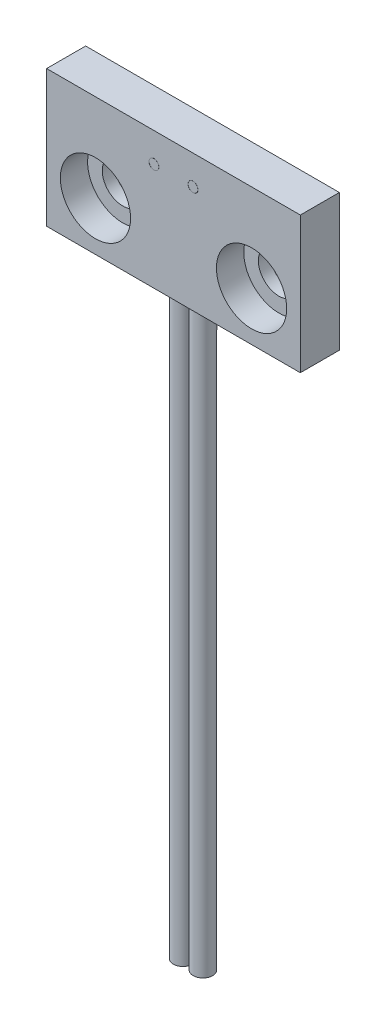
ISO-10303-21;
HEADER;
FILE_DESCRIPTION(('STEP AP214'),'2;1');
FILE_NAME('part.step','',(''),(''),'','','');
FILE_SCHEMA(('AUTOMOTIVE_DESIGN { 1 0 10303 214 1 1 1 1 }'));
ENDSEC;
DATA;
#1=APPLICATION_CONTEXT('core data for automotive mechanical design processes');
#2=APPLICATION_PROTOCOL_DEFINITION('international standard','automotive_design',2000,#1);
#3=PRODUCT_CONTEXT('',#1,'mechanical');
#4=PRODUCT('Part','Part','',(#3));
#5=PRODUCT_RELATED_PRODUCT_CATEGORY('part','',(#4));
#6=PRODUCT_DEFINITION_FORMATION('','',#4);
#7=PRODUCT_DEFINITION_CONTEXT('part definition',#1,'design');
#8=PRODUCT_DEFINITION('design','',#6,#7);
#9=PRODUCT_DEFINITION_SHAPE('','',#8);
#10=(LENGTH_UNIT() NAMED_UNIT(*) SI_UNIT(.MILLI.,.METRE.));
#11=(NAMED_UNIT(*) PLANE_ANGLE_UNIT() SI_UNIT($,.RADIAN.));
#12=(NAMED_UNIT(*) SI_UNIT($,.STERADIAN.) SOLID_ANGLE_UNIT());
#13=UNCERTAINTY_MEASURE_WITH_UNIT(LENGTH_MEASURE(1.E-05),#10,'distance_accuracy_value','');
#14=(GEOMETRIC_REPRESENTATION_CONTEXT(3) GLOBAL_UNCERTAINTY_ASSIGNED_CONTEXT((#13)) GLOBAL_UNIT_ASSIGNED_CONTEXT((#10,
#11,#12)) REPRESENTATION_CONTEXT('',''));
#15=CARTESIAN_POINT('',(0.,0.,0.));
#16=DIRECTION('',(0.,0.,1.));
#17=DIRECTION('',(1.,0.,0.));
#18=AXIS2_PLACEMENT_3D('',#15,#16,#17);
#19=CARTESIAN_POINT('',(-6.5,-3.5,1.));
#20=DIRECTION('',(1.,0.,0.));
#21=DIRECTION('',(0.,0.,-1.));
#22=AXIS2_PLACEMENT_3D('',#19,#20,#21);
#23=PLANE('',#22);
#24=DIRECTION('',(0.,-1.,0.));
#25=VECTOR('',#24,1.);
#26=CARTESIAN_POINT('',(-6.5,-3.5,-1.));
#27=LINE('',#26,#25);
#28=CARTESIAN_POINT('',(-6.5,3.5,-1.));
#29=VERTEX_POINT('',#28);
#30=CARTESIAN_POINT('',(-6.5,-3.5,-1.));
#31=VERTEX_POINT('',#30);
#32=EDGE_CURVE('E102',#29,#31,#27,.T.);
#33=ORIENTED_EDGE('',*,*,#32,.T.);
#34=DIRECTION('',(0.,0.,-1.));
#35=VECTOR('',#34,1.);
#36=CARTESIAN_POINT('',(-6.5,-3.5,1.));
#37=LINE('',#36,#35);
#38=CARTESIAN_POINT('',(-6.5,-3.5,1.));
#39=VERTEX_POINT('',#38);
#40=EDGE_CURVE('E93',#39,#31,#37,.T.);
#41=ORIENTED_EDGE('',*,*,#40,.F.);
#42=DIRECTION('',(0.,-1.,0.));
#43=VECTOR('',#42,1.);
#44=CARTESIAN_POINT('',(-6.5,-3.5,1.));
#45=LINE('',#44,#43);
#46=CARTESIAN_POINT('',(-6.5,3.5,1.));
#47=VERTEX_POINT('',#46);
#48=EDGE_CURVE('E87',#47,#39,#45,.T.);
#49=ORIENTED_EDGE('',*,*,#48,.F.);
#50=DIRECTION('',(0.,0.,-1.));
#51=VECTOR('',#50,1.);
#52=CARTESIAN_POINT('',(-6.5,3.5,1.));
#53=LINE('',#52,#51);
#54=EDGE_CURVE('E98',#47,#29,#53,.T.);
#55=ORIENTED_EDGE('',*,*,#54,.T.);
#56=EDGE_LOOP('',(#33,#41,#49,#55));
#57=FACE_BOUND('',#56,.T.);
#58=ADVANCED_FACE('F35',(#57),#23,.F.);
#59=CARTESIAN_POINT('',(6.5,-3.5,1.));
#60=DIRECTION('',(0.,1.,0.));
#61=DIRECTION('',(-1.,0.,0.));
#62=AXIS2_PLACEMENT_3D('',#59,#60,#61);
#63=PLANE('',#62);
#64=CARTESIAN_POINT('',(-0.51,-3.5,0.));
#65=DIRECTION('',(0.,1.,0.));
#66=DIRECTION('',(-1.,0.,0.));
#67=AXIS2_PLACEMENT_3D('',#64,#65,#66);
#68=CIRCLE('',#67,0.5);
#69=CARTESIAN_POINT('',(-1.01,-3.5,0.));
#70=VERTEX_POINT('',#69);
#71=EDGE_CURVE('E11',#70,#70,#68,.F.);
#72=ORIENTED_EDGE('',*,*,#71,.F.);
#73=EDGE_LOOP('',(#72));
#74=FACE_BOUND('',#73,.T.);
#75=CARTESIAN_POINT('',(0.51,-3.5,0.));
#76=DIRECTION('',(0.,1.,0.));
#77=DIRECTION('',(-1.,0.,0.));
#78=AXIS2_PLACEMENT_3D('',#75,#76,#77);
#79=CIRCLE('',#78,0.5);
#80=CARTESIAN_POINT('',(0.0100000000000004,-3.5,0.));
#81=VERTEX_POINT('',#80);
#82=EDGE_CURVE('E43',#81,#81,#79,.F.);
#83=ORIENTED_EDGE('',*,*,#82,.F.);
#84=EDGE_LOOP('',(#83));
#85=FACE_BOUND('',#84,.T.);
#86=DIRECTION('',(1.,0.,0.));
#87=VECTOR('',#86,1.);
#88=CARTESIAN_POINT('',(6.5,-3.5,-1.));
#89=LINE('',#88,#87);
#90=CARTESIAN_POINT('',(6.5,-3.5,-1.));
#91=VERTEX_POINT('',#90);
#92=EDGE_CURVE('E92',#31,#91,#89,.T.);
#93=ORIENTED_EDGE('',*,*,#92,.T.);
#94=DIRECTION('',(0.,0.,-1.));
#95=VECTOR('',#94,1.);
#96=CARTESIAN_POINT('',(6.5,-3.5,1.));
#97=LINE('',#96,#95);
#98=CARTESIAN_POINT('',(6.5,-3.5,1.));
#99=VERTEX_POINT('',#98);
#100=EDGE_CURVE('E90',#99,#91,#97,.T.);
#101=ORIENTED_EDGE('',*,*,#100,.F.);
#102=DIRECTION('',(1.,0.,0.));
#103=VECTOR('',#102,1.);
#104=CARTESIAN_POINT('',(6.5,-3.5,1.));
#105=LINE('',#104,#103);
#106=EDGE_CURVE('E82',#39,#99,#105,.T.);
#107=ORIENTED_EDGE('',*,*,#106,.F.);
#108=ORIENTED_EDGE('',*,*,#40,.T.);
#109=EDGE_LOOP('',(#93,#101,#107,#108));
#110=FACE_BOUND('',#109,.T.);
#111=ADVANCED_FACE('F91',(#74,#85,#110),#63,.F.);
#112=CARTESIAN_POINT('',(6.5,-3.5,1.));
#113=DIRECTION('',(-1.,0.,0.));
#114=DIRECTION('',(0.,0.,1.));
#115=AXIS2_PLACEMENT_3D('',#112,#113,#114);
#116=PLANE('',#115);
#117=DIRECTION('',(0.,1.,0.));
#118=VECTOR('',#117,1.);
#119=CARTESIAN_POINT('',(6.5,-3.5,-1.));
#120=LINE('',#119,#118);
#121=CARTESIAN_POINT('',(6.5,3.5,-1.));
#122=VERTEX_POINT('',#121);
#123=EDGE_CURVE('E68',#91,#122,#120,.T.);
#124=ORIENTED_EDGE('',*,*,#123,.T.);
#125=DIRECTION('',(0.,0.,-1.));
#126=VECTOR('',#125,1.);
#127=CARTESIAN_POINT('',(6.5,3.5,1.));
#128=LINE('',#127,#126);
#129=CARTESIAN_POINT('',(6.5,3.5,1.));
#130=VERTEX_POINT('',#129);
#131=EDGE_CURVE('E94',#130,#122,#128,.T.);
#132=ORIENTED_EDGE('',*,*,#131,.F.);
#133=DIRECTION('',(0.,1.,0.));
#134=VECTOR('',#133,1.);
#135=CARTESIAN_POINT('',(6.5,-3.5,1.));
#136=LINE('',#135,#134);
#137=EDGE_CURVE('E85',#99,#130,#136,.T.);
#138=ORIENTED_EDGE('',*,*,#137,.F.);
#139=ORIENTED_EDGE('',*,*,#100,.T.);
#140=EDGE_LOOP('',(#124,#132,#138,#139));
#141=FACE_BOUND('',#140,.T.);
#142=ADVANCED_FACE('F96',(#141),#116,.F.);
#143=CARTESIAN_POINT('',(6.5,3.5,1.));
#144=DIRECTION('',(0.,-1.,0.));
#145=DIRECTION('',(1.,0.,0.));
#146=AXIS2_PLACEMENT_3D('',#143,#144,#145);
#147=PLANE('',#146);
#148=DIRECTION('',(-1.,0.,0.));
#149=VECTOR('',#148,1.);
#150=CARTESIAN_POINT('',(6.5,3.5,-1.));
#151=LINE('',#150,#149);
#152=EDGE_CURVE('E74',#122,#29,#151,.T.);
#153=ORIENTED_EDGE('',*,*,#152,.T.);
#154=ORIENTED_EDGE('',*,*,#54,.F.);
#155=DIRECTION('',(-1.,0.,0.));
#156=VECTOR('',#155,1.);
#157=CARTESIAN_POINT('',(6.5,3.5,1.));
#158=LINE('',#157,#156);
#159=EDGE_CURVE('E51',#130,#47,#158,.T.);
#160=ORIENTED_EDGE('',*,*,#159,.F.);
#161=ORIENTED_EDGE('',*,*,#131,.T.);
#162=EDGE_LOOP('',(#153,#154,#160,#161));
#163=FACE_BOUND('',#162,.T.);
#164=ADVANCED_FACE('F122',(#163),#147,.F.);
#165=CARTESIAN_POINT('',(0.,0.,1.));
#166=DIRECTION('',(0.,0.,1.));
#167=DIRECTION('',(1.,0.,0.));
#168=AXIS2_PLACEMENT_3D('',#165,#166,#167);
#169=PLANE('',#168);
#170=CARTESIAN_POINT('',(-1.,2.,1.));
#171=DIRECTION('',(0.,0.,1.));
#172=DIRECTION('',(1.,0.,0.));
#173=AXIS2_PLACEMENT_3D('',#170,#171,#172);
#174=CIRCLE('',#173,0.255);
#175=CARTESIAN_POINT('',(-0.745,2.,1.));
#176=VERTEX_POINT('',#175);
#177=EDGE_CURVE('E214',#176,#176,#174,.T.);
#178=ORIENTED_EDGE('',*,*,#177,.F.);
#179=EDGE_LOOP('',(#178));
#180=FACE_BOUND('',#179,.T.);
#181=CARTESIAN_POINT('',(1.,2.,1.));
#182=DIRECTION('',(0.,0.,1.));
#183=DIRECTION('',(1.,0.,0.));
#184=AXIS2_PLACEMENT_3D('',#181,#182,#183);
#185=CIRCLE('',#184,0.255);
#186=CARTESIAN_POINT('',(1.255,2.,1.));
#187=VERTEX_POINT('',#186);
#188=EDGE_CURVE('E217',#187,#187,#185,.T.);
#189=ORIENTED_EDGE('',*,*,#188,.F.);
#190=EDGE_LOOP('',(#189));
#191=FACE_BOUND('',#190,.T.);
#192=CARTESIAN_POINT('',(-4.,-0.999999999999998,1.));
#193=DIRECTION('',(0.,0.,1.));
#194=DIRECTION('',(1.,0.,0.));
#195=AXIS2_PLACEMENT_3D('',#192,#193,#194);
#196=CIRCLE('',#195,1.8);
#197=CARTESIAN_POINT('',(-2.2,-0.999999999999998,1.));
#198=VERTEX_POINT('',#197);
#199=EDGE_CURVE('E239',#198,#198,#196,.T.);
#200=ORIENTED_EDGE('',*,*,#199,.F.);
#201=EDGE_LOOP('',(#200));
#202=FACE_BOUND('',#201,.T.);
#203=CARTESIAN_POINT('',(4.,-0.999999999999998,1.));
#204=DIRECTION('',(0.,0.,1.));
#205=DIRECTION('',(1.,0.,0.));
#206=AXIS2_PLACEMENT_3D('',#203,#204,#205);
#207=CIRCLE('',#206,1.8);
#208=CARTESIAN_POINT('',(5.8,-0.999999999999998,1.));
#209=VERTEX_POINT('',#208);
#210=EDGE_CURVE('E251',#209,#209,#207,.T.);
#211=ORIENTED_EDGE('',*,*,#210,.F.);
#212=EDGE_LOOP('',(#211));
#213=FACE_BOUND('',#212,.T.);
#214=ORIENTED_EDGE('',*,*,#48,.T.);
#215=ORIENTED_EDGE('',*,*,#106,.T.);
#216=ORIENTED_EDGE('',*,*,#137,.T.);
#217=ORIENTED_EDGE('',*,*,#159,.T.);
#218=EDGE_LOOP('',(#214,#215,#216,#217));
#219=FACE_BOUND('',#218,.T.);
#220=ADVANCED_FACE('F83',(#180,#191,#202,#213,#219),#169,.T.);
#221=CARTESIAN_POINT('',(0.,0.,-1.));
#222=DIRECTION('',(0.,0.,1.));
#223=DIRECTION('',(1.,0.,0.));
#224=AXIS2_PLACEMENT_3D('',#221,#222,#223);
#225=PLANE('',#224);
#226=CARTESIAN_POINT('',(-4.,-0.999999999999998,-1.));
#227=DIRECTION('',(0.,0.,1.));
#228=DIRECTION('',(1.,0.,0.));
#229=AXIS2_PLACEMENT_3D('',#226,#227,#228);
#230=CIRCLE('',#229,1.05);
#231=CARTESIAN_POINT('',(-2.95,-0.999999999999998,-1.));
#232=VERTEX_POINT('',#231);
#233=EDGE_CURVE('E248',#232,#232,#230,.T.);
#234=ORIENTED_EDGE('',*,*,#233,.T.);
#235=EDGE_LOOP('',(#234));
#236=FACE_BOUND('',#235,.T.);
#237=CARTESIAN_POINT('',(4.,-0.999999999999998,-1.));
#238=DIRECTION('',(0.,0.,1.));
#239=DIRECTION('',(1.,0.,0.));
#240=AXIS2_PLACEMENT_3D('',#237,#238,#239);
#241=CIRCLE('',#240,1.05);
#242=CARTESIAN_POINT('',(5.05,-0.999999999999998,-1.));
#243=VERTEX_POINT('',#242);
#244=EDGE_CURVE('E105',#243,#243,#241,.T.);
#245=ORIENTED_EDGE('',*,*,#244,.T.);
#246=EDGE_LOOP('',(#245));
#247=FACE_BOUND('',#246,.T.);
#248=ORIENTED_EDGE('',*,*,#32,.F.);
#249=ORIENTED_EDGE('',*,*,#152,.F.);
#250=ORIENTED_EDGE('',*,*,#123,.F.);
#251=ORIENTED_EDGE('',*,*,#92,.F.);
#252=EDGE_LOOP('',(#248,#249,#250,#251));
#253=FACE_BOUND('',#252,.T.);
#254=ADVANCED_FACE('F129',(#236,#247,#253),#225,.F.);
#255=CARTESIAN_POINT('',(4.,-0.999999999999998,1.));
#256=DIRECTION('',(0.,0.,1.));
#257=DIRECTION('',(1.,0.,0.));
#258=AXIS2_PLACEMENT_3D('',#255,#256,#257);
#259=CYLINDRICAL_SURFACE('',#258,1.05);
#260=ORIENTED_EDGE('',*,*,#244,.F.);
#261=EDGE_LOOP('',(#260));
#262=FACE_BOUND('',#261,.T.);
#263=CARTESIAN_POINT('',(4.,-0.999999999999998,-0.4));
#264=DIRECTION('',(0.,0.,1.));
#265=DIRECTION('',(1.,0.,0.));
#266=AXIS2_PLACEMENT_3D('',#263,#264,#265);
#267=CIRCLE('',#266,1.05);
#268=CARTESIAN_POINT('',(5.05,-0.999999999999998,-0.4));
#269=VERTEX_POINT('',#268);
#270=EDGE_CURVE('E257',#269,#269,#267,.T.);
#271=ORIENTED_EDGE('',*,*,#270,.T.);
#272=EDGE_LOOP('',(#271));
#273=FACE_BOUND('',#272,.T.);
#274=ADVANCED_FACE('F132',(#262,#273),#259,.F.);
#275=CARTESIAN_POINT('',(5.05,-0.999999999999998,-0.4));
#276=DIRECTION('',(0.,0.,-1.));
#277=DIRECTION('',(-1.,0.,0.));
#278=AXIS2_PLACEMENT_3D('',#275,#276,#277);
#279=PLANE('',#278);
#280=ORIENTED_EDGE('',*,*,#270,.F.);
#281=EDGE_LOOP('',(#280));
#282=FACE_BOUND('',#281,.T.);
#283=CARTESIAN_POINT('',(4.,-0.999999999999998,-0.4));
#284=DIRECTION('',(0.,0.,1.));
#285=DIRECTION('',(1.,0.,0.));
#286=AXIS2_PLACEMENT_3D('',#283,#284,#285);
#287=CIRCLE('',#286,1.8);
#288=CARTESIAN_POINT('',(5.8,-0.999999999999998,-0.4));
#289=VERTEX_POINT('',#288);
#290=EDGE_CURVE('E254',#289,#289,#287,.T.);
#291=ORIENTED_EDGE('',*,*,#290,.T.);
#292=EDGE_LOOP('',(#291));
#293=FACE_BOUND('',#292,.T.);
#294=ADVANCED_FACE('F141',(#282,#293),#279,.F.);
#295=CARTESIAN_POINT('',(4.,-0.999999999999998,1.));
#296=DIRECTION('',(0.,0.,1.));
#297=DIRECTION('',(1.,0.,0.));
#298=AXIS2_PLACEMENT_3D('',#295,#296,#297);
#299=CYLINDRICAL_SURFACE('',#298,1.8);
#300=ORIENTED_EDGE('',*,*,#290,.F.);
#301=EDGE_LOOP('',(#300));
#302=FACE_BOUND('',#301,.T.);
#303=ORIENTED_EDGE('',*,*,#210,.T.);
#304=EDGE_LOOP('',(#303));
#305=FACE_BOUND('',#304,.T.);
#306=ADVANCED_FACE('F145',(#302,#305),#299,.F.);
#307=CARTESIAN_POINT('',(-4.,-0.999999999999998,1.));
#308=DIRECTION('',(0.,0.,1.));
#309=DIRECTION('',(1.,0.,0.));
#310=AXIS2_PLACEMENT_3D('',#307,#308,#309);
#311=CYLINDRICAL_SURFACE('',#310,1.05);
#312=ORIENTED_EDGE('',*,*,#233,.F.);
#313=EDGE_LOOP('',(#312));
#314=FACE_BOUND('',#313,.T.);
#315=CARTESIAN_POINT('',(-4.,-0.999999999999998,-0.4));
#316=DIRECTION('',(0.,0.,1.));
#317=DIRECTION('',(1.,0.,0.));
#318=AXIS2_PLACEMENT_3D('',#315,#316,#317);
#319=CIRCLE('',#318,1.05);
#320=CARTESIAN_POINT('',(-2.95,-0.999999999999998,-0.4));
#321=VERTEX_POINT('',#320);
#322=EDGE_CURVE('E245',#321,#321,#319,.T.);
#323=ORIENTED_EDGE('',*,*,#322,.T.);
#324=EDGE_LOOP('',(#323));
#325=FACE_BOUND('',#324,.T.);
#326=ADVANCED_FACE('F149',(#314,#325),#311,.F.);
#327=CARTESIAN_POINT('',(-2.95,-0.999999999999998,-0.4));
#328=DIRECTION('',(0.,0.,-1.));
#329=DIRECTION('',(-1.,0.,0.));
#330=AXIS2_PLACEMENT_3D('',#327,#328,#329);
#331=PLANE('',#330);
#332=ORIENTED_EDGE('',*,*,#322,.F.);
#333=EDGE_LOOP('',(#332));
#334=FACE_BOUND('',#333,.T.);
#335=CARTESIAN_POINT('',(-4.,-0.999999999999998,-0.4));
#336=DIRECTION('',(0.,0.,1.));
#337=DIRECTION('',(1.,0.,0.));
#338=AXIS2_PLACEMENT_3D('',#335,#336,#337);
#339=CIRCLE('',#338,1.8);
#340=CARTESIAN_POINT('',(-2.2,-0.999999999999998,-0.4));
#341=VERTEX_POINT('',#340);
#342=EDGE_CURVE('E242',#341,#341,#339,.T.);
#343=ORIENTED_EDGE('',*,*,#342,.T.);
#344=EDGE_LOOP('',(#343));
#345=FACE_BOUND('',#344,.T.);
#346=ADVANCED_FACE('F153',(#334,#345),#331,.F.);
#347=CARTESIAN_POINT('',(-4.,-0.999999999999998,1.));
#348=DIRECTION('',(0.,0.,1.));
#349=DIRECTION('',(1.,0.,0.));
#350=AXIS2_PLACEMENT_3D('',#347,#348,#349);
#351=CYLINDRICAL_SURFACE('',#350,1.8);
#352=ORIENTED_EDGE('',*,*,#342,.F.);
#353=EDGE_LOOP('',(#352));
#354=FACE_BOUND('',#353,.T.);
#355=ORIENTED_EDGE('',*,*,#199,.T.);
#356=EDGE_LOOP('',(#355));
#357=FACE_BOUND('',#356,.T.);
#358=ADVANCED_FACE('F157',(#354,#357),#351,.F.);
#359=CARTESIAN_POINT('',(0.510000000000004,-33.5,0.));
#360=DIRECTION('',(0.,1.,0.));
#361=DIRECTION('',(-1.,0.,0.));
#362=AXIS2_PLACEMENT_3D('',#359,#360,#361);
#363=CYLINDRICAL_SURFACE('',#362,0.5);
#364=CARTESIAN_POINT('',(0.510000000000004,-33.5,0.));
#365=DIRECTION('',(0.,-1.,0.));
#366=DIRECTION('',(1.,0.,0.));
#367=AXIS2_PLACEMENT_3D('',#364,#365,#366);
#368=CIRCLE('',#367,0.5);
#369=CARTESIAN_POINT('',(1.01,-33.5,0.));
#370=VERTEX_POINT('',#369);
#371=EDGE_CURVE('E236',#370,#370,#368,.T.);
#372=ORIENTED_EDGE('',*,*,#371,.F.);
#373=EDGE_LOOP('',(#372));
#374=FACE_BOUND('',#373,.T.);
#375=ORIENTED_EDGE('',*,*,#82,.T.);
#376=EDGE_LOOP('',(#375));
#377=FACE_BOUND('',#376,.T.);
#378=ADVANCED_FACE('F114',(#374,#377),#363,.T.);
#379=CARTESIAN_POINT('',(0.510000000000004,-33.5,0.));
#380=DIRECTION('',(0.,-1.,0.));
#381=DIRECTION('',(1.,0.,0.));
#382=AXIS2_PLACEMENT_3D('',#379,#380,#381);
#383=PLANE('',#382);
#384=ORIENTED_EDGE('',*,*,#371,.T.);
#385=EDGE_LOOP('',(#384));
#386=FACE_BOUND('',#385,.T.);
#387=ADVANCED_FACE('F164',(#386),#383,.T.);
#388=CARTESIAN_POINT('',(-0.509999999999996,-33.5,0.));
#389=DIRECTION('',(0.,1.,0.));
#390=DIRECTION('',(-1.,0.,0.));
#391=AXIS2_PLACEMENT_3D('',#388,#389,#390);
#392=CYLINDRICAL_SURFACE('',#391,0.5);
#393=CARTESIAN_POINT('',(-0.509999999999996,-33.5,0.));
#394=DIRECTION('',(0.,-1.,0.));
#395=DIRECTION('',(1.,0.,0.));
#396=AXIS2_PLACEMENT_3D('',#393,#394,#395);
#397=CIRCLE('',#396,0.5);
#398=CARTESIAN_POINT('',(-0.00999999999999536,-33.5,0.));
#399=VERTEX_POINT('',#398);
#400=EDGE_CURVE('E223',#399,#399,#397,.T.);
#401=ORIENTED_EDGE('',*,*,#400,.F.);
#402=EDGE_LOOP('',(#401));
#403=FACE_BOUND('',#402,.T.);
#404=ORIENTED_EDGE('',*,*,#71,.T.);
#405=EDGE_LOOP('',(#404));
#406=FACE_BOUND('',#405,.T.);
#407=ADVANCED_FACE('F168',(#403,#406),#392,.T.);
#408=CARTESIAN_POINT('',(-0.509999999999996,-33.5,0.));
#409=DIRECTION('',(0.,-1.,0.));
#410=DIRECTION('',(1.,0.,0.));
#411=AXIS2_PLACEMENT_3D('',#408,#409,#410);
#412=PLANE('',#411);
#413=ORIENTED_EDGE('',*,*,#400,.T.);
#414=EDGE_LOOP('',(#413));
#415=FACE_BOUND('',#414,.T.);
#416=ADVANCED_FACE('F172',(#415),#412,.T.);
#417=CARTESIAN_POINT('',(1.,2.,0.9));
#418=DIRECTION('',(0.,0.,1.));
#419=DIRECTION('',(1.,0.,0.));
#420=AXIS2_PLACEMENT_3D('',#417,#418,#419);
#421=CYLINDRICAL_SURFACE('',#420,0.255);
#422=CARTESIAN_POINT('',(1.,2.,0.9));
#423=DIRECTION('',(0.,0.,1.));
#424=DIRECTION('',(1.,0.,0.));
#425=AXIS2_PLACEMENT_3D('',#422,#423,#424);
#426=CIRCLE('',#425,0.255);
#427=CARTESIAN_POINT('',(1.255,2.,0.9));
#428=VERTEX_POINT('',#427);
#429=EDGE_CURVE('E212',#428,#428,#426,.T.);
#430=ORIENTED_EDGE('',*,*,#429,.F.);
#431=EDGE_LOOP('',(#430));
#432=FACE_BOUND('',#431,.T.);
#433=ORIENTED_EDGE('',*,*,#188,.T.);
#434=EDGE_LOOP('',(#433));
#435=FACE_BOUND('',#434,.T.);
#436=ADVANCED_FACE('F176',(#432,#435),#421,.F.);
#437=CARTESIAN_POINT('',(1.,2.,0.9));
#438=DIRECTION('',(0.,0.,1.));
#439=DIRECTION('',(1.,0.,0.));
#440=AXIS2_PLACEMENT_3D('',#437,#438,#439);
#441=PLANE('',#440);
#442=CARTESIAN_POINT('',(1.,2.,0.9));
#443=DIRECTION('',(0.,0.,1.));
#444=DIRECTION('',(1.,0.,0.));
#445=AXIS2_PLACEMENT_3D('',#442,#443,#444);
#446=CIRCLE('',#445,0.25);
#447=CARTESIAN_POINT('',(1.25,2.,0.9));
#448=VERTEX_POINT('',#447);
#449=EDGE_CURVE('E226',#448,#448,#446,.T.);
#450=ORIENTED_EDGE('',*,*,#449,.F.);
#451=EDGE_LOOP('',(#450));
#452=FACE_BOUND('',#451,.T.);
#453=ORIENTED_EDGE('',*,*,#429,.T.);
#454=EDGE_LOOP('',(#453));
#455=FACE_BOUND('',#454,.T.);
#456=ADVANCED_FACE('F180',(#452,#455),#441,.T.);
#457=CARTESIAN_POINT('',(1.,2.,0.9));
#458=DIRECTION('',(0.,0.,1.));
#459=DIRECTION('',(1.,0.,0.));
#460=AXIS2_PLACEMENT_3D('',#457,#458,#459);
#461=CYLINDRICAL_SURFACE('',#460,0.25);
#462=ORIENTED_EDGE('',*,*,#449,.T.);
#463=EDGE_LOOP('',(#462));
#464=FACE_BOUND('',#463,.T.);
#465=CARTESIAN_POINT('',(1.,2.,1.));
#466=DIRECTION('',(0.,0.,1.));
#467=DIRECTION('',(1.,0.,0.));
#468=AXIS2_PLACEMENT_3D('',#465,#466,#467);
#469=CIRCLE('',#468,0.25);
#470=CARTESIAN_POINT('',(1.25,2.,1.));
#471=VERTEX_POINT('',#470);
#472=EDGE_CURVE('E229',#471,#471,#469,.T.);
#473=ORIENTED_EDGE('',*,*,#472,.F.);
#474=EDGE_LOOP('',(#473));
#475=FACE_BOUND('',#474,.T.);
#476=ADVANCED_FACE('F184',(#464,#475),#461,.T.);
#477=CARTESIAN_POINT('',(-1.,2.,0.9));
#478=DIRECTION('',(0.,0.,1.));
#479=DIRECTION('',(1.,0.,0.));
#480=AXIS2_PLACEMENT_3D('',#477,#478,#479);
#481=CYLINDRICAL_SURFACE('',#480,0.255);
#482=CARTESIAN_POINT('',(-1.,2.,0.9));
#483=DIRECTION('',(0.,0.,1.));
#484=DIRECTION('',(1.,0.,0.));
#485=AXIS2_PLACEMENT_3D('',#482,#483,#484);
#486=CIRCLE('',#485,0.255);
#487=CARTESIAN_POINT('',(-0.745,2.,0.9));
#488=VERTEX_POINT('',#487);
#489=EDGE_CURVE('E220',#488,#488,#486,.T.);
#490=ORIENTED_EDGE('',*,*,#489,.F.);
#491=EDGE_LOOP('',(#490));
#492=FACE_BOUND('',#491,.T.);
#493=ORIENTED_EDGE('',*,*,#177,.T.);
#494=EDGE_LOOP('',(#493));
#495=FACE_BOUND('',#494,.T.);
#496=ADVANCED_FACE('F188',(#492,#495),#481,.F.);
#497=CARTESIAN_POINT('',(-1.,2.,0.9));
#498=DIRECTION('',(0.,0.,1.));
#499=DIRECTION('',(1.,0.,0.));
#500=AXIS2_PLACEMENT_3D('',#497,#498,#499);
#501=PLANE('',#500);
#502=CARTESIAN_POINT('',(-1.,2.,0.9));
#503=DIRECTION('',(0.,0.,1.));
#504=DIRECTION('',(1.,0.,0.));
#505=AXIS2_PLACEMENT_3D('',#502,#503,#504);
#506=CIRCLE('',#505,0.25);
#507=CARTESIAN_POINT('',(-0.75,2.,0.9));
#508=VERTEX_POINT('',#507);
#509=EDGE_CURVE('E207',#508,#508,#506,.T.);
#510=ORIENTED_EDGE('',*,*,#509,.F.);
#511=EDGE_LOOP('',(#510));
#512=FACE_BOUND('',#511,.T.);
#513=ORIENTED_EDGE('',*,*,#489,.T.);
#514=EDGE_LOOP('',(#513));
#515=FACE_BOUND('',#514,.T.);
#516=ADVANCED_FACE('F192',(#512,#515),#501,.T.);
#517=CARTESIAN_POINT('',(-1.,2.,0.9));
#518=DIRECTION('',(0.,0.,1.));
#519=DIRECTION('',(1.,0.,0.));
#520=AXIS2_PLACEMENT_3D('',#517,#518,#519);
#521=CYLINDRICAL_SURFACE('',#520,0.25);
#522=ORIENTED_EDGE('',*,*,#509,.T.);
#523=EDGE_LOOP('',(#522));
#524=FACE_BOUND('',#523,.T.);
#525=CARTESIAN_POINT('',(-1.,2.,1.));
#526=DIRECTION('',(0.,0.,1.));
#527=DIRECTION('',(1.,0.,0.));
#528=AXIS2_PLACEMENT_3D('',#525,#526,#527);
#529=CIRCLE('',#528,0.25);
#530=CARTESIAN_POINT('',(-0.75,2.,1.));
#531=VERTEX_POINT('',#530);
#532=EDGE_CURVE('E210',#531,#531,#529,.T.);
#533=ORIENTED_EDGE('',*,*,#532,.F.);
#534=EDGE_LOOP('',(#533));
#535=FACE_BOUND('',#534,.T.);
#536=ADVANCED_FACE('F196',(#524,#535),#521,.T.);
#537=ORIENTED_EDGE('',*,*,#472,.T.);
#538=EDGE_LOOP('',(#537));
#539=FACE_BOUND('',#538,.T.);
#540=ADVANCED_FACE('F138',(#539),#169,.T.);
#541=ORIENTED_EDGE('',*,*,#532,.T.);
#542=EDGE_LOOP('',(#541));
#543=FACE_BOUND('',#542,.T.);
#544=ADVANCED_FACE('F137',(#543),#169,.T.);
#545=CLOSED_SHELL('',(#58,#111,#142,#164,#220,#254,#274,#294,#306,#326,#346,#358,#378,#387,#407,
#416,#436,#456,#476,#496,#516,#536,#540,#544));
#546=MANIFOLD_SOLID_BREP('B2',#545);
#547=ADVANCED_BREP_SHAPE_REPRESENTATION('',(#18,#546),#14);
#548=SHAPE_DEFINITION_REPRESENTATION(#9,#547);
ENDSEC;
END-ISO-10303-21;
